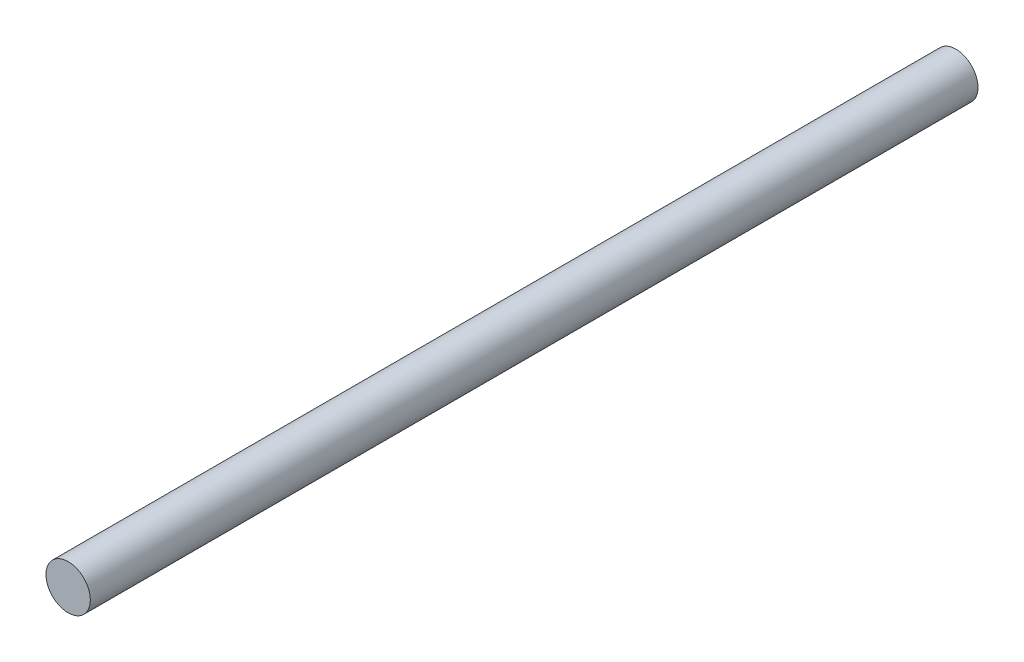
ISO-10303-21;
HEADER;
FILE_DESCRIPTION(('STEP AP214'),'2;1');
FILE_NAME('part.step','',(''),(''),'','','');
FILE_SCHEMA(('AUTOMOTIVE_DESIGN { 1 0 10303 214 1 1 1 1 }'));
ENDSEC;
DATA;
#1=APPLICATION_CONTEXT('core data for automotive mechanical design processes');
#2=APPLICATION_PROTOCOL_DEFINITION('international standard','automotive_design',2000,#1);
#3=PRODUCT_CONTEXT('',#1,'mechanical');
#4=PRODUCT('Part','Part','',(#3));
#5=PRODUCT_RELATED_PRODUCT_CATEGORY('part','',(#4));
#6=PRODUCT_DEFINITION_FORMATION('','',#4);
#7=PRODUCT_DEFINITION_CONTEXT('part definition',#1,'design');
#8=PRODUCT_DEFINITION('design','',#6,#7);
#9=PRODUCT_DEFINITION_SHAPE('','',#8);
#10=(LENGTH_UNIT() NAMED_UNIT(*) SI_UNIT(.MILLI.,.METRE.));
#11=(NAMED_UNIT(*) PLANE_ANGLE_UNIT() SI_UNIT($,.RADIAN.));
#12=(NAMED_UNIT(*) SI_UNIT($,.STERADIAN.) SOLID_ANGLE_UNIT());
#13=UNCERTAINTY_MEASURE_WITH_UNIT(LENGTH_MEASURE(1.E-05),#10,'distance_accuracy_value','');
#14=(GEOMETRIC_REPRESENTATION_CONTEXT(3) GLOBAL_UNCERTAINTY_ASSIGNED_CONTEXT((#13)) GLOBAL_UNIT_ASSIGNED_CONTEXT((#10,
#11,#12)) REPRESENTATION_CONTEXT('',''));
#15=CARTESIAN_POINT('',(0.,0.,0.));
#16=DIRECTION('',(0.,0.,1.));
#17=DIRECTION('',(1.,0.,0.));
#18=AXIS2_PLACEMENT_3D('',#15,#16,#17);
#19=CARTESIAN_POINT('',(0.,0.,40.64));
#20=DIRECTION('',(0.,0.,-1.));
#21=DIRECTION('',(-1.,0.,0.));
#22=AXIS2_PLACEMENT_3D('',#19,#20,#21);
#23=CYLINDRICAL_SURFACE('',#22,1.016);
#24=CARTESIAN_POINT('',(0.,0.,40.64));
#25=DIRECTION('',(0.,0.,1.));
#26=DIRECTION('',(1.,0.,0.));
#27=AXIS2_PLACEMENT_3D('',#24,#25,#26);
#28=CIRCLE('',#27,1.016);
#29=CARTESIAN_POINT('',(1.016,0.,40.64));
#30=VERTEX_POINT('',#29);
#31=EDGE_CURVE('E10',#30,#30,#28,.T.);
#32=ORIENTED_EDGE('',*,*,#31,.F.);
#33=EDGE_LOOP('',(#32));
#34=FACE_BOUND('',#33,.T.);
#35=CARTESIAN_POINT('',(0.,0.,0.));
#36=DIRECTION('',(0.,0.,1.));
#37=DIRECTION('',(1.,0.,0.));
#38=AXIS2_PLACEMENT_3D('',#35,#36,#37);
#39=CIRCLE('',#38,1.016);
#40=CARTESIAN_POINT('',(1.016,0.,0.));
#41=VERTEX_POINT('',#40);
#42=EDGE_CURVE('E34',#41,#41,#39,.T.);
#43=ORIENTED_EDGE('',*,*,#42,.T.);
#44=EDGE_LOOP('',(#43));
#45=FACE_BOUND('',#44,.T.);
#46=ADVANCED_FACE('F31',(#34,#45),#23,.T.);
#47=CARTESIAN_POINT('',(0.,0.,40.64));
#48=DIRECTION('',(0.,0.,1.));
#49=DIRECTION('',(1.,0.,0.));
#50=AXIS2_PLACEMENT_3D('',#47,#48,#49);
#51=PLANE('',#50);
#52=ORIENTED_EDGE('',*,*,#31,.T.);
#53=EDGE_LOOP('',(#52));
#54=FACE_BOUND('',#53,.T.);
#55=ADVANCED_FACE('F46',(#54),#51,.T.);
#56=CARTESIAN_POINT('',(0.,0.,0.));
#57=DIRECTION('',(0.,0.,1.));
#58=DIRECTION('',(1.,0.,0.));
#59=AXIS2_PLACEMENT_3D('',#56,#57,#58);
#60=PLANE('',#59);
#61=ORIENTED_EDGE('',*,*,#42,.F.);
#62=EDGE_LOOP('',(#61));
#63=FACE_BOUND('',#62,.T.);
#64=ADVANCED_FACE('F44',(#63),#60,.F.);
#65=CLOSED_SHELL('',(#46,#55,#64));
#66=MANIFOLD_SOLID_BREP('B2',#65);
#67=ADVANCED_BREP_SHAPE_REPRESENTATION('',(#18,#66),#14);
#68=SHAPE_DEFINITION_REPRESENTATION(#9,#67);
ENDSEC;
END-ISO-10303-21;
